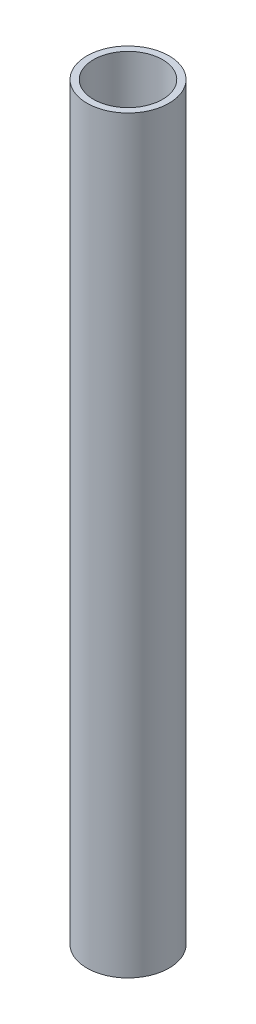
from build123d import *

# Parameters (mm, degrees)
SKETCH1_R           = 12.5
SKETCH1_R_2         = 10.5
BOSS_EXTRUDE1_DEPTH = 228


with BuildPart() as part:
    # Sketch1 → Boss-Extrude1 (new body)
    with BuildSketch(Plane(origin=(0, 0, 0), x_dir=(1, 0, 0), z_dir=(0, 1, 0))):
        with Locations(Location((0, 0, 0), (0, 0, 90))):
            Circle(SKETCH1_R)
        with Locations(Location((0, 0, 0), (0, 0, 90))):
            Circle(SKETCH1_R_2, mode=Mode.SUBTRACT)
    extrude(amount=BOSS_EXTRUDE1_DEPTH)


solid = part.part
